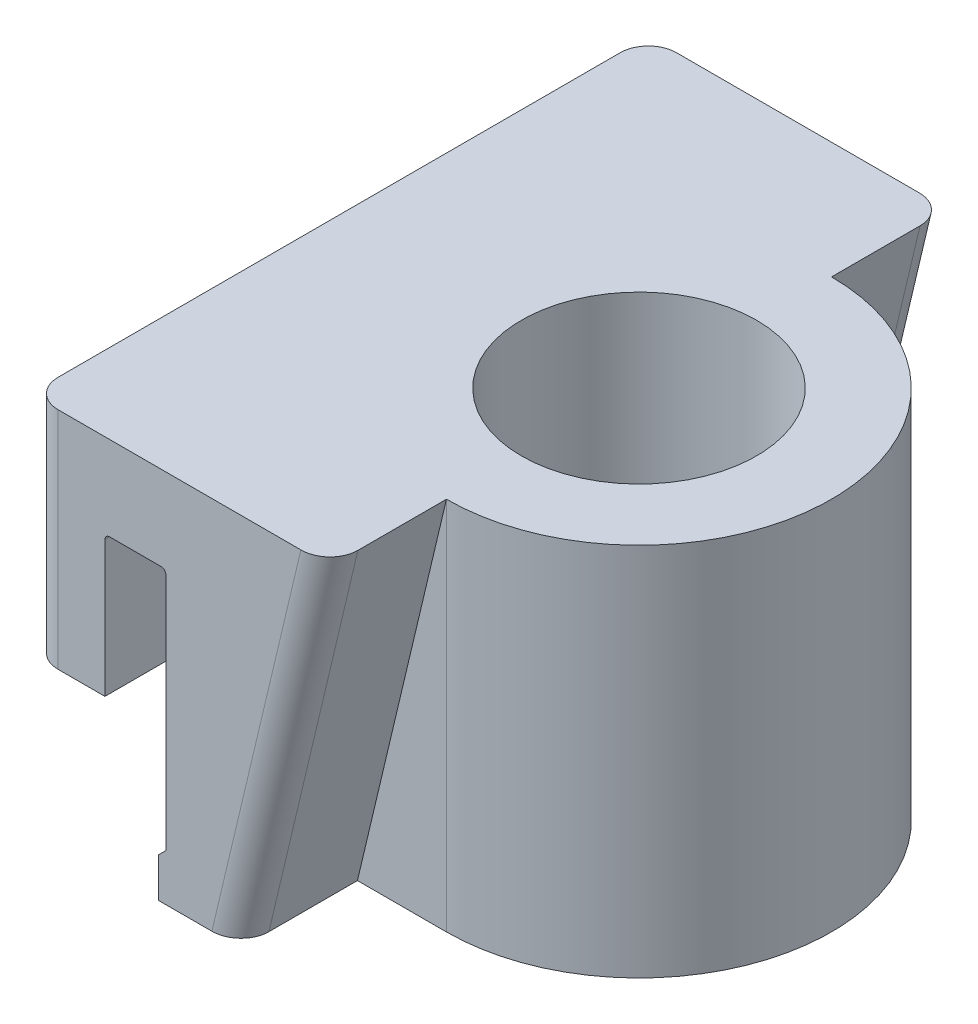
ISO-10303-21;
HEADER;
FILE_DESCRIPTION(('STEP AP214'),'2;1');
FILE_NAME('part.step','',(''),(''),'','','');
FILE_SCHEMA(('AUTOMOTIVE_DESIGN { 1 0 10303 214 1 1 1 1 }'));
ENDSEC;
DATA;
#1=APPLICATION_CONTEXT('core data for automotive mechanical design processes');
#2=APPLICATION_PROTOCOL_DEFINITION('international standard','automotive_design',2000,#1);
#3=PRODUCT_CONTEXT('',#1,'mechanical');
#4=PRODUCT('Part','Part','',(#3));
#5=PRODUCT_RELATED_PRODUCT_CATEGORY('part','',(#4));
#6=PRODUCT_DEFINITION_FORMATION('','',#4);
#7=PRODUCT_DEFINITION_CONTEXT('part definition',#1,'design');
#8=PRODUCT_DEFINITION('design','',#6,#7);
#9=PRODUCT_DEFINITION_SHAPE('','',#8);
#10=(LENGTH_UNIT() NAMED_UNIT(*) SI_UNIT(.MILLI.,.METRE.));
#11=(NAMED_UNIT(*) PLANE_ANGLE_UNIT() SI_UNIT($,.RADIAN.));
#12=(NAMED_UNIT(*) SI_UNIT($,.STERADIAN.) SOLID_ANGLE_UNIT());
#13=UNCERTAINTY_MEASURE_WITH_UNIT(LENGTH_MEASURE(1.E-05),#10,'distance_accuracy_value','');
#14=(GEOMETRIC_REPRESENTATION_CONTEXT(3) GLOBAL_UNCERTAINTY_ASSIGNED_CONTEXT((#13)) GLOBAL_UNIT_ASSIGNED_CONTEXT((#10,
#11,#12)) REPRESENTATION_CONTEXT('',''));
#15=CARTESIAN_POINT('',(0.,0.,0.));
#16=DIRECTION('',(0.,0.,1.));
#17=DIRECTION('',(1.,0.,0.));
#18=AXIS2_PLACEMENT_3D('',#15,#16,#17);
#19=CARTESIAN_POINT('',(-17.5,-40.,-33.));
#20=DIRECTION('',(1.,0.,0.));
#21=DIRECTION('',(0.,0.,-1.));
#22=AXIS2_PLACEMENT_3D('',#19,#20,#21);
#23=PLANE('',#22);
#24=DIRECTION('',(0.,0.,-1.));
#25=VECTOR('',#24,1.);
#26=CARTESIAN_POINT('',(-17.5,-35.,-33.));
#27=LINE('',#26,#25);
#28=CARTESIAN_POINT('',(-17.5,-35.,33.));
#29=VERTEX_POINT('',#28);
#30=CARTESIAN_POINT('',(-17.5,-35.,-33.));
#31=VERTEX_POINT('',#30);
#32=EDGE_CURVE('E174',#29,#31,#27,.T.);
#33=ORIENTED_EDGE('',*,*,#32,.F.);
#34=DIRECTION('',(0.,1.,0.));
#35=VECTOR('',#34,1.);
#36=CARTESIAN_POINT('',(-17.5,-40.,33.));
#37=LINE('',#36,#35);
#38=CARTESIAN_POINT('',(-17.5,-9.5,33.));
#39=VERTEX_POINT('',#38);
#40=EDGE_CURVE('E234',#29,#39,#37,.T.);
#41=ORIENTED_EDGE('',*,*,#40,.T.);
#42=DIRECTION('',(0.,0.,1.));
#43=VECTOR('',#42,1.);
#44=CARTESIAN_POINT('',(-17.5,-9.5,-33.));
#45=LINE('',#44,#43);
#46=CARTESIAN_POINT('',(-17.5,-9.5,-33.));
#47=VERTEX_POINT('',#46);
#48=EDGE_CURVE('E311',#39,#47,#45,.F.);
#49=ORIENTED_EDGE('',*,*,#48,.T.);
#50=DIRECTION('',(0.,1.,0.));
#51=VECTOR('',#50,1.);
#52=CARTESIAN_POINT('',(-17.5,-40.,-33.));
#53=LINE('',#52,#51);
#54=EDGE_CURVE('E226',#31,#47,#53,.T.);
#55=ORIENTED_EDGE('',*,*,#54,.F.);
#56=EDGE_LOOP('',(#33,#41,#49,#55));
#57=FACE_BOUND('',#56,.T.);
#58=ADVANCED_FACE('F36',(#57),#23,.F.);
#59=CARTESIAN_POINT('',(0.,-40.,-33.));
#60=DIRECTION('',(0.,0.,-1.));
#61=DIRECTION('',(-1.,0.,0.));
#62=AXIS2_PLACEMENT_3D('',#59,#60,#61);
#63=PLANE('',#62);
#64=DIRECTION('',(0.,-1.,0.));
#65=VECTOR('',#64,1.);
#66=CARTESIAN_POINT('',(-18.3,-40.,-33.));
#67=LINE('',#66,#65);
#68=CARTESIAN_POINT('',(-18.3,-35.8,-33.));
#69=VERTEX_POINT('',#68);
#70=CARTESIAN_POINT('',(-18.3,-40.,-33.));
#71=VERTEX_POINT('',#70);
#72=EDGE_CURVE('E167',#69,#71,#67,.T.);
#73=ORIENTED_EDGE('',*,*,#72,.F.);
#74=DIRECTION('',(-0.707106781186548,-0.707106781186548,0.));
#75=VECTOR('',#74,1.);
#76=CARTESIAN_POINT('',(-11.25,-28.75,-33.));
#77=LINE('',#76,#75);
#78=EDGE_CURVE('E44',#69,#31,#77,.F.);
#79=ORIENTED_EDGE('',*,*,#78,.T.);
#80=ORIENTED_EDGE('',*,*,#54,.T.);
#81=CARTESIAN_POINT('',(-18.,-9.5,-33.));
#82=DIRECTION('',(0.,0.,-1.));
#83=DIRECTION('',(-1.,0.,0.));
#84=AXIS2_PLACEMENT_3D('',#81,#82,#83);
#85=CIRCLE('',#84,0.5);
#86=CARTESIAN_POINT('',(-18.,-9.,-33.));
#87=VERTEX_POINT('',#86);
#88=EDGE_CURVE('E321',#47,#87,#85,.F.);
#89=ORIENTED_EDGE('',*,*,#88,.T.);
#90=DIRECTION('',(-1.,0.,0.));
#91=VECTOR('',#90,1.);
#92=CARTESIAN_POINT('',(-24.,-9.,-33.));
#93=LINE('',#92,#91);
#94=CARTESIAN_POINT('',(-23.5,-9.,-33.));
#95=VERTEX_POINT('',#94);
#96=EDGE_CURVE('E229',#87,#95,#93,.T.);
#97=ORIENTED_EDGE('',*,*,#96,.T.);
#98=CARTESIAN_POINT('',(-23.5,-9.5,-33.));
#99=DIRECTION('',(0.,0.,-1.));
#100=DIRECTION('',(-1.,0.,0.));
#101=AXIS2_PLACEMENT_3D('',#98,#99,#100);
#102=CIRCLE('',#101,0.5);
#103=CARTESIAN_POINT('',(-24.,-9.5,-33.));
#104=VERTEX_POINT('',#103);
#105=EDGE_CURVE('E316',#95,#104,#102,.F.);
#106=ORIENTED_EDGE('',*,*,#105,.T.);
#107=DIRECTION('',(0.,-1.,0.));
#108=VECTOR('',#107,1.);
#109=CARTESIAN_POINT('',(-24.,-40.,-33.));
#110=LINE('',#109,#108);
#111=CARTESIAN_POINT('',(-24.,-24.,-33.));
#112=VERTEX_POINT('',#111);
#113=EDGE_CURVE('E224',#104,#112,#110,.T.);
#114=ORIENTED_EDGE('',*,*,#113,.T.);
#115=DIRECTION('',(-1.,0.,0.));
#116=VECTOR('',#115,1.);
#117=CARTESIAN_POINT('',(-32.,-24.,-33.));
#118=LINE('',#117,#116);
#119=CARTESIAN_POINT('',(-29.,-24.,-33.));
#120=VERTEX_POINT('',#119);
#121=EDGE_CURVE('E212',#112,#120,#118,.T.);
#122=ORIENTED_EDGE('',*,*,#121,.T.);
#123=DIRECTION('',(0.,1.,0.));
#124=VECTOR('',#123,1.);
#125=CARTESIAN_POINT('',(-29.,-40.,-33.));
#126=LINE('',#125,#124);
#127=CARTESIAN_POINT('',(-29.,0.,-33.));
#128=VERTEX_POINT('',#127);
#129=EDGE_CURVE('E270',#120,#128,#126,.T.);
#130=ORIENTED_EDGE('',*,*,#129,.T.);
#131=DIRECTION('',(-1.,0.,0.));
#132=VECTOR('',#131,1.);
#133=CARTESIAN_POINT('',(0.,0.,-33.));
#134=LINE('',#133,#132);
#135=CARTESIAN_POINT('',(-3.08344875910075,0.,-33.));
#136=VERTEX_POINT('',#135);
#137=EDGE_CURVE('E254',#136,#128,#134,.T.);
#138=ORIENTED_EDGE('',*,*,#137,.F.);
#139=DIRECTION('',(-0.231072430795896,-0.972936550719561,0.));
#140=VECTOR('',#139,1.);
#141=CARTESIAN_POINT('',(-11.9115622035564,-37.1710039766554,-33.));
#142=LINE('',#141,#140);
#143=CARTESIAN_POINT('',(-12.5834487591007,-40.,-33.));
#144=VERTEX_POINT('',#143);
#145=EDGE_CURVE('E182',#136,#144,#142,.T.);
#146=ORIENTED_EDGE('',*,*,#145,.T.);
#147=DIRECTION('',(-1.,0.,0.));
#148=VECTOR('',#147,1.);
#149=CARTESIAN_POINT('',(0.,-40.,-33.));
#150=LINE('',#149,#148);
#151=EDGE_CURVE('E178',#144,#71,#150,.T.);
#152=ORIENTED_EDGE('',*,*,#151,.T.);
#153=EDGE_LOOP('',(#73,#79,#80,#89,#97,#106,#114,#122,#130,#138,#146,#152));
#154=FACE_BOUND('',#153,.T.);
#155=ADVANCED_FACE('F179',(#154),#63,.T.);
#156=CARTESIAN_POINT('',(0.,-40.,0.));
#157=DIRECTION('',(0.,-1.,0.));
#158=DIRECTION('',(0.,0.,-1.));
#159=AXIS2_PLACEMENT_3D('',#156,#157,#158);
#160=PLANE('',#159);
#161=CARTESIAN_POINT('',(0.,-40.,0.));
#162=DIRECTION('',(0.,1.,0.));
#163=DIRECTION('',(0.,0.,1.));
#164=AXIS2_PLACEMENT_3D('',#161,#162,#163);
#165=CIRCLE('',#164,12.55);
#166=CARTESIAN_POINT('',(0.,-40.,12.55));
#167=VERTEX_POINT('',#166);
#168=EDGE_CURVE('E238',#167,#167,#165,.T.);
#169=ORIENTED_EDGE('',*,*,#168,.T.);
#170=EDGE_LOOP('',(#169));
#171=FACE_BOUND('',#170,.T.);
#172=ORIENTED_EDGE('',*,*,#151,.F.);
#173=CARTESIAN_POINT('',(-12.5834487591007,-40.,-30.));
#174=DIRECTION('',(0.,-1.,0.));
#175=DIRECTION('',(-1.,0.,0.));
#176=AXIS2_PLACEMENT_3D('',#173,#174,#175);
#177=ELLIPSE('',#176,3.08344875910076,3.);
#178=CARTESIAN_POINT('',(-9.49999999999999,-40.,-30.));
#179=VERTEX_POINT('',#178);
#180=EDGE_CURVE('E292',#144,#179,#177,.T.);
#181=ORIENTED_EDGE('',*,*,#180,.T.);
#182=DIRECTION('',(0.,0.,-1.));
#183=VECTOR('',#182,1.);
#184=CARTESIAN_POINT('',(-9.49999999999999,-40.,-20.55));
#185=LINE('',#184,#183);
#186=CARTESIAN_POINT('',(-9.49999999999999,-40.,-20.55));
#187=VERTEX_POINT('',#186);
#188=EDGE_CURVE('E200',#187,#179,#185,.T.);
#189=ORIENTED_EDGE('',*,*,#188,.F.);
#190=DIRECTION('',(1.,0.,0.));
#191=VECTOR('',#190,1.);
#192=CARTESIAN_POINT('',(0.,-40.,-20.55));
#193=LINE('',#192,#191);
#194=CARTESIAN_POINT('',(0.,-40.,-20.55));
#195=VERTEX_POINT('',#194);
#196=EDGE_CURVE('E197',#187,#195,#193,.T.);
#197=ORIENTED_EDGE('',*,*,#196,.T.);
#198=CARTESIAN_POINT('',(0.,-40.,0.));
#199=DIRECTION('',(0.,1.,0.));
#200=DIRECTION('',(0.,0.,-1.));
#201=AXIS2_PLACEMENT_3D('',#198,#199,#200);
#202=CIRCLE('',#201,20.55);
#203=CARTESIAN_POINT('',(0.,-40.,20.55));
#204=VERTEX_POINT('',#203);
#205=EDGE_CURVE('E185',#204,#195,#202,.T.);
#206=ORIENTED_EDGE('',*,*,#205,.F.);
#207=DIRECTION('',(1.,0.,0.));
#208=VECTOR('',#207,1.);
#209=CARTESIAN_POINT('',(0.,-40.,20.55));
#210=LINE('',#209,#208);
#211=CARTESIAN_POINT('',(-9.49999999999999,-40.,20.55));
#212=VERTEX_POINT('',#211);
#213=EDGE_CURVE('E203',#212,#204,#210,.T.);
#214=ORIENTED_EDGE('',*,*,#213,.F.);
#215=DIRECTION('',(0.,0.,1.));
#216=VECTOR('',#215,1.);
#217=CARTESIAN_POINT('',(-9.49999999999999,-40.,20.55));
#218=LINE('',#217,#216);
#219=CARTESIAN_POINT('',(-9.49999999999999,-40.,30.));
#220=VERTEX_POINT('',#219);
#221=EDGE_CURVE('E208',#212,#220,#218,.T.);
#222=ORIENTED_EDGE('',*,*,#221,.T.);
#223=CARTESIAN_POINT('',(-12.5834487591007,-40.,30.));
#224=DIRECTION('',(0.,-1.,0.));
#225=DIRECTION('',(1.,0.,0.));
#226=AXIS2_PLACEMENT_3D('',#223,#224,#225);
#227=ELLIPSE('',#226,3.08344875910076,3.);
#228=CARTESIAN_POINT('',(-12.5834487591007,-40.,33.));
#229=VERTEX_POINT('',#228);
#230=EDGE_CURVE('E290',#220,#229,#227,.T.);
#231=ORIENTED_EDGE('',*,*,#230,.T.);
#232=DIRECTION('',(1.,0.,0.));
#233=VECTOR('',#232,1.);
#234=CARTESIAN_POINT('',(0.,-40.,33.));
#235=LINE('',#234,#233);
#236=CARTESIAN_POINT('',(-18.3,-40.,33.));
#237=VERTEX_POINT('',#236);
#238=EDGE_CURVE('E184',#237,#229,#235,.T.);
#239=ORIENTED_EDGE('',*,*,#238,.F.);
#240=DIRECTION('',(0.,0.,1.));
#241=VECTOR('',#240,1.);
#242=CARTESIAN_POINT('',(-18.3,-40.,-33.));
#243=LINE('',#242,#241);
#244=EDGE_CURVE('E171',#71,#237,#243,.T.);
#245=ORIENTED_EDGE('',*,*,#244,.F.);
#246=EDGE_LOOP('',(#172,#181,#189,#197,#206,#214,#222,#231,#239,#245));
#247=FACE_BOUND('',#246,.T.);
#248=ADVANCED_FACE('F187',(#171,#247),#160,.T.);
#249=CARTESIAN_POINT('',(0.,-40.,0.));
#250=DIRECTION('',(0.,1.,0.));
#251=DIRECTION('',(0.,0.,1.));
#252=AXIS2_PLACEMENT_3D('',#249,#250,#251);
#253=CYLINDRICAL_SURFACE('',#252,20.55);
#254=CARTESIAN_POINT('',(0.,0.,0.));
#255=DIRECTION('',(0.,1.,0.));
#256=DIRECTION('',(0.,0.,-1.));
#257=AXIS2_PLACEMENT_3D('',#254,#255,#256);
#258=CIRCLE('',#257,20.55);
#259=CARTESIAN_POINT('',(0.,0.,20.55));
#260=VERTEX_POINT('',#259);
#261=CARTESIAN_POINT('',(0.,0.,-20.55));
#262=VERTEX_POINT('',#261);
#263=EDGE_CURVE('E241',#260,#262,#258,.T.);
#264=ORIENTED_EDGE('',*,*,#263,.F.);
#265=DIRECTION('',(0.,1.,0.));
#266=VECTOR('',#265,1.);
#267=CARTESIAN_POINT('',(0.,-40.,20.55));
#268=LINE('',#267,#266);
#269=EDGE_CURVE('E264',#204,#260,#268,.T.);
#270=ORIENTED_EDGE('',*,*,#269,.F.);
#271=ORIENTED_EDGE('',*,*,#205,.T.);
#272=DIRECTION('',(0.,1.,0.));
#273=VECTOR('',#272,1.);
#274=CARTESIAN_POINT('',(0.,-40.,-20.55));
#275=LINE('',#274,#273);
#276=EDGE_CURVE('E248',#195,#262,#275,.T.);
#277=ORIENTED_EDGE('',*,*,#276,.T.);
#278=EDGE_LOOP('',(#264,#270,#271,#277));
#279=FACE_BOUND('',#278,.T.);
#280=ADVANCED_FACE('F354',(#279),#253,.T.);
#281=CARTESIAN_POINT('',(0.,-40.,33.));
#282=DIRECTION('',(0.,0.,1.));
#283=DIRECTION('',(1.,0.,0.));
#284=AXIS2_PLACEMENT_3D('',#281,#282,#283);
#285=PLANE('',#284);
#286=ORIENTED_EDGE('',*,*,#40,.F.);
#287=DIRECTION('',(0.707106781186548,0.707106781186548,0.));
#288=VECTOR('',#287,1.);
#289=CARTESIAN_POINT('',(-11.25,-28.75,33.));
#290=LINE('',#289,#288);
#291=CARTESIAN_POINT('',(-18.3,-35.8,33.));
#292=VERTEX_POINT('',#291);
#293=EDGE_CURVE('E11',#29,#292,#290,.F.);
#294=ORIENTED_EDGE('',*,*,#293,.T.);
#295=DIRECTION('',(0.,1.,0.));
#296=VECTOR('',#295,1.);
#297=CARTESIAN_POINT('',(-18.3,-40.,33.));
#298=LINE('',#297,#296);
#299=EDGE_CURVE('E189',#237,#292,#298,.T.);
#300=ORIENTED_EDGE('',*,*,#299,.F.);
#301=ORIENTED_EDGE('',*,*,#238,.T.);
#302=DIRECTION('',(-0.231072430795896,-0.972936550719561,0.));
#303=VECTOR('',#302,1.);
#304=CARTESIAN_POINT('',(-2.91880965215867,0.6932172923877,33.));
#305=LINE('',#304,#303);
#306=CARTESIAN_POINT('',(-3.08344875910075,0.,33.));
#307=VERTEX_POINT('',#306);
#308=EDGE_CURVE('E296',#229,#307,#305,.F.);
#309=ORIENTED_EDGE('',*,*,#308,.T.);
#310=DIRECTION('',(1.,0.,0.));
#311=VECTOR('',#310,1.);
#312=CARTESIAN_POINT('',(0.,0.,33.));
#313=LINE('',#312,#311);
#314=CARTESIAN_POINT('',(-29.,0.,33.));
#315=VERTEX_POINT('',#314);
#316=EDGE_CURVE('E260',#315,#307,#313,.T.);
#317=ORIENTED_EDGE('',*,*,#316,.F.);
#318=DIRECTION('',(0.,1.,0.));
#319=VECTOR('',#318,1.);
#320=CARTESIAN_POINT('',(-29.,-40.,33.));
#321=LINE('',#320,#319);
#322=CARTESIAN_POINT('',(-29.,-24.,33.));
#323=VERTEX_POINT('',#322);
#324=EDGE_CURVE('E298',#315,#323,#321,.F.);
#325=ORIENTED_EDGE('',*,*,#324,.T.);
#326=DIRECTION('',(-1.,0.,0.));
#327=VECTOR('',#326,1.);
#328=CARTESIAN_POINT('',(-32.,-24.,33.));
#329=LINE('',#328,#327);
#330=CARTESIAN_POINT('',(-24.,-24.,33.));
#331=VERTEX_POINT('',#330);
#332=EDGE_CURVE('E211',#331,#323,#329,.T.);
#333=ORIENTED_EDGE('',*,*,#332,.F.);
#334=DIRECTION('',(0.,-1.,0.));
#335=VECTOR('',#334,1.);
#336=CARTESIAN_POINT('',(-24.,-40.,33.));
#337=LINE('',#336,#335);
#338=CARTESIAN_POINT('',(-24.,-9.5,33.));
#339=VERTEX_POINT('',#338);
#340=EDGE_CURVE('E221',#339,#331,#337,.T.);
#341=ORIENTED_EDGE('',*,*,#340,.F.);
#342=CARTESIAN_POINT('',(-23.5,-9.5,33.));
#343=DIRECTION('',(0.,0.,1.));
#344=DIRECTION('',(1.,0.,0.));
#345=AXIS2_PLACEMENT_3D('',#342,#343,#344);
#346=CIRCLE('',#345,0.5);
#347=CARTESIAN_POINT('',(-23.5,-9.,33.));
#348=VERTEX_POINT('',#347);
#349=EDGE_CURVE('E314',#339,#348,#346,.F.);
#350=ORIENTED_EDGE('',*,*,#349,.T.);
#351=DIRECTION('',(-1.,0.,0.));
#352=VECTOR('',#351,1.);
#353=CARTESIAN_POINT('',(-24.,-9.,33.));
#354=LINE('',#353,#352);
#355=CARTESIAN_POINT('',(-18.,-9.,33.));
#356=VERTEX_POINT('',#355);
#357=EDGE_CURVE('E227',#356,#348,#354,.T.);
#358=ORIENTED_EDGE('',*,*,#357,.F.);
#359=CARTESIAN_POINT('',(-18.,-9.5,33.));
#360=DIRECTION('',(0.,0.,1.));
#361=DIRECTION('',(1.,0.,0.));
#362=AXIS2_PLACEMENT_3D('',#359,#360,#361);
#363=CIRCLE('',#362,0.5);
#364=EDGE_CURVE('E318',#356,#39,#363,.F.);
#365=ORIENTED_EDGE('',*,*,#364,.T.);
#366=EDGE_LOOP('',(#286,#294,#300,#301,#309,#317,#325,#333,#341,#350,#358,#365));
#367=FACE_BOUND('',#366,.T.);
#368=ADVANCED_FACE('F360',(#367),#285,.T.);
#369=CARTESIAN_POINT('',(-32.,-40.,-33.));
#370=DIRECTION('',(-1.,0.,0.));
#371=DIRECTION('',(0.,0.,1.));
#372=AXIS2_PLACEMENT_3D('',#369,#370,#371);
#373=PLANE('',#372);
#374=DIRECTION('',(0.,0.,1.));
#375=VECTOR('',#374,1.);
#376=CARTESIAN_POINT('',(-32.,0.,-33.));
#377=LINE('',#376,#375);
#378=CARTESIAN_POINT('',(-32.,0.,-30.));
#379=VERTEX_POINT('',#378);
#380=CARTESIAN_POINT('',(-32.,0.,30.));
#381=VERTEX_POINT('',#380);
#382=EDGE_CURVE('E257',#379,#381,#377,.T.);
#383=ORIENTED_EDGE('',*,*,#382,.F.);
#384=DIRECTION('',(0.,1.,0.));
#385=VECTOR('',#384,1.);
#386=CARTESIAN_POINT('',(-32.,-40.,-30.));
#387=LINE('',#386,#385);
#388=CARTESIAN_POINT('',(-32.,-24.,-30.));
#389=VERTEX_POINT('',#388);
#390=EDGE_CURVE('E284',#379,#389,#387,.F.);
#391=ORIENTED_EDGE('',*,*,#390,.T.);
#392=DIRECTION('',(0.,0.,1.));
#393=VECTOR('',#392,1.);
#394=CARTESIAN_POINT('',(-32.,-24.,-33.));
#395=LINE('',#394,#393);
#396=CARTESIAN_POINT('',(-32.,-24.,30.));
#397=VERTEX_POINT('',#396);
#398=EDGE_CURVE('E218',#389,#397,#395,.T.);
#399=ORIENTED_EDGE('',*,*,#398,.T.);
#400=DIRECTION('',(0.,1.,0.));
#401=VECTOR('',#400,1.);
#402=CARTESIAN_POINT('',(-32.,-40.,30.));
#403=LINE('',#402,#401);
#404=EDGE_CURVE('E281',#397,#381,#403,.T.);
#405=ORIENTED_EDGE('',*,*,#404,.T.);
#406=EDGE_LOOP('',(#383,#391,#399,#405));
#407=FACE_BOUND('',#406,.T.);
#408=ADVANCED_FACE('F358',(#407),#373,.T.);
#409=CARTESIAN_POINT('',(0.,0.,0.));
#410=DIRECTION('',(0.,-1.,0.));
#411=DIRECTION('',(0.,0.,-1.));
#412=AXIS2_PLACEMENT_3D('',#409,#410,#411);
#413=PLANE('',#412);
#414=CARTESIAN_POINT('',(0.,0.,0.));
#415=DIRECTION('',(0.,1.,0.));
#416=DIRECTION('',(0.,0.,1.));
#417=AXIS2_PLACEMENT_3D('',#414,#415,#416);
#418=CIRCLE('',#417,12.55);
#419=CARTESIAN_POINT('',(0.,0.,12.55));
#420=VERTEX_POINT('',#419);
#421=EDGE_CURVE('E232',#420,#420,#418,.T.);
#422=ORIENTED_EDGE('',*,*,#421,.F.);
#423=EDGE_LOOP('',(#422));
#424=FACE_BOUND('',#423,.T.);
#425=ORIENTED_EDGE('',*,*,#137,.T.);
#426=CARTESIAN_POINT('',(-29.,0.,-30.));
#427=DIRECTION('',(0.,-1.,0.));
#428=DIRECTION('',(0.,0.,-1.));
#429=AXIS2_PLACEMENT_3D('',#426,#427,#428);
#430=CIRCLE('',#429,3.);
#431=EDGE_CURVE('E279',#128,#379,#430,.F.);
#432=ORIENTED_EDGE('',*,*,#431,.T.);
#433=ORIENTED_EDGE('',*,*,#382,.T.);
#434=CARTESIAN_POINT('',(-29.,0.,30.));
#435=DIRECTION('',(0.,-1.,0.));
#436=DIRECTION('',(0.,0.,-1.));
#437=AXIS2_PLACEMENT_3D('',#434,#435,#436);
#438=CIRCLE('',#437,3.);
#439=EDGE_CURVE('E275',#381,#315,#438,.F.);
#440=ORIENTED_EDGE('',*,*,#439,.T.);
#441=ORIENTED_EDGE('',*,*,#316,.T.);
#442=CARTESIAN_POINT('',(-3.08344875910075,0.,30.));
#443=DIRECTION('',(0.,-1.,0.));
#444=DIRECTION('',(1.,0.,0.));
#445=AXIS2_PLACEMENT_3D('',#442,#443,#444);
#446=ELLIPSE('',#445,3.08344875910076,3.);
#447=CARTESIAN_POINT('',(0.,0.,30.));
#448=VERTEX_POINT('',#447);
#449=EDGE_CURVE('E273',#307,#448,#446,.F.);
#450=ORIENTED_EDGE('',*,*,#449,.T.);
#451=DIRECTION('',(0.,0.,-1.));
#452=VECTOR('',#451,1.);
#453=CARTESIAN_POINT('',(0.,0.,20.55));
#454=LINE('',#453,#452);
#455=EDGE_CURVE('E245',#448,#260,#454,.T.);
#456=ORIENTED_EDGE('',*,*,#455,.T.);
#457=ORIENTED_EDGE('',*,*,#263,.T.);
#458=DIRECTION('',(0.,0.,-1.));
#459=VECTOR('',#458,1.);
#460=CARTESIAN_POINT('',(0.,0.,-20.55));
#461=LINE('',#460,#459);
#462=CARTESIAN_POINT('',(0.,0.,-30.));
#463=VERTEX_POINT('',#462);
#464=EDGE_CURVE('E251',#262,#463,#461,.T.);
#465=ORIENTED_EDGE('',*,*,#464,.T.);
#466=CARTESIAN_POINT('',(-3.08344875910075,0.,-30.));
#467=DIRECTION('',(0.,-1.,0.));
#468=DIRECTION('',(-1.,0.,0.));
#469=AXIS2_PLACEMENT_3D('',#466,#467,#468);
#470=ELLIPSE('',#469,3.08344875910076,3.);
#471=EDGE_CURVE('E277',#463,#136,#470,.F.);
#472=ORIENTED_EDGE('',*,*,#471,.T.);
#473=EDGE_LOOP('',(#425,#432,#433,#440,#441,#450,#456,#457,#465,#472));
#474=FACE_BOUND('',#473,.T.);
#475=ADVANCED_FACE('F350',(#424,#474),#413,.F.);
#476=CARTESIAN_POINT('',(0.,-40.,0.));
#477=DIRECTION('',(0.,1.,0.));
#478=DIRECTION('',(0.,0.,1.));
#479=AXIS2_PLACEMENT_3D('',#476,#477,#478);
#480=CYLINDRICAL_SURFACE('',#479,12.55);
#481=ORIENTED_EDGE('',*,*,#168,.F.);
#482=EDGE_LOOP('',(#481));
#483=FACE_BOUND('',#482,.T.);
#484=ORIENTED_EDGE('',*,*,#421,.T.);
#485=EDGE_LOOP('',(#484));
#486=FACE_BOUND('',#485,.T.);
#487=ADVANCED_FACE('F346',(#483,#486),#480,.F.);
#488=CARTESIAN_POINT('',(-24.,-40.,-33.));
#489=DIRECTION('',(-1.,0.,0.));
#490=DIRECTION('',(0.,0.,1.));
#491=AXIS2_PLACEMENT_3D('',#488,#489,#490);
#492=PLANE('',#491);
#493=ORIENTED_EDGE('',*,*,#113,.F.);
#494=DIRECTION('',(0.,0.,1.));
#495=VECTOR('',#494,1.);
#496=CARTESIAN_POINT('',(-24.,-9.5,33.));
#497=LINE('',#496,#495);
#498=EDGE_CURVE('E303',#104,#339,#497,.T.);
#499=ORIENTED_EDGE('',*,*,#498,.T.);
#500=ORIENTED_EDGE('',*,*,#340,.T.);
#501=DIRECTION('',(0.,0.,1.));
#502=VECTOR('',#501,1.);
#503=CARTESIAN_POINT('',(-24.,-24.,-33.));
#504=LINE('',#503,#502);
#505=EDGE_CURVE('E215',#112,#331,#504,.T.);
#506=ORIENTED_EDGE('',*,*,#505,.F.);
#507=EDGE_LOOP('',(#493,#499,#500,#506));
#508=FACE_BOUND('',#507,.T.);
#509=ADVANCED_FACE('F343',(#508),#492,.F.);
#510=CARTESIAN_POINT('',(-24.,-9.,-33.));
#511=DIRECTION('',(0.,1.,0.));
#512=DIRECTION('',(-1.,0.,0.));
#513=AXIS2_PLACEMENT_3D('',#510,#511,#512);
#514=PLANE('',#513);
#515=ORIENTED_EDGE('',*,*,#357,.T.);
#516=DIRECTION('',(0.,0.,1.));
#517=VECTOR('',#516,1.);
#518=CARTESIAN_POINT('',(-23.5,-9.,-33.));
#519=LINE('',#518,#517);
#520=EDGE_CURVE('E309',#348,#95,#519,.F.);
#521=ORIENTED_EDGE('',*,*,#520,.T.);
#522=ORIENTED_EDGE('',*,*,#96,.F.);
#523=DIRECTION('',(0.,0.,1.));
#524=VECTOR('',#523,1.);
#525=CARTESIAN_POINT('',(-18.,-9.,33.));
#526=LINE('',#525,#524);
#527=EDGE_CURVE('E306',#87,#356,#526,.T.);
#528=ORIENTED_EDGE('',*,*,#527,.T.);
#529=EDGE_LOOP('',(#515,#521,#522,#528));
#530=FACE_BOUND('',#529,.T.);
#531=ADVANCED_FACE('F341',(#530),#514,.F.);
#532=CARTESIAN_POINT('',(-32.,-24.,-33.));
#533=DIRECTION('',(0.,1.,0.));
#534=DIRECTION('',(0.,0.,1.));
#535=AXIS2_PLACEMENT_3D('',#532,#533,#534);
#536=PLANE('',#535);
#537=ORIENTED_EDGE('',*,*,#398,.F.);
#538=CARTESIAN_POINT('',(-29.,-24.,-30.));
#539=DIRECTION('',(0.,1.,0.));
#540=DIRECTION('',(0.,0.,1.));
#541=AXIS2_PLACEMENT_3D('',#538,#539,#540);
#542=CIRCLE('',#541,3.);
#543=EDGE_CURVE('E288',#389,#120,#542,.F.);
#544=ORIENTED_EDGE('',*,*,#543,.T.);
#545=ORIENTED_EDGE('',*,*,#121,.F.);
#546=ORIENTED_EDGE('',*,*,#505,.T.);
#547=ORIENTED_EDGE('',*,*,#332,.T.);
#548=CARTESIAN_POINT('',(-29.,-24.,30.));
#549=DIRECTION('',(0.,1.,0.));
#550=DIRECTION('',(0.,0.,1.));
#551=AXIS2_PLACEMENT_3D('',#548,#549,#550);
#552=CIRCLE('',#551,3.);
#553=EDGE_CURVE('E286',#323,#397,#552,.F.);
#554=ORIENTED_EDGE('',*,*,#553,.T.);
#555=EDGE_LOOP('',(#537,#544,#545,#546,#547,#554));
#556=FACE_BOUND('',#555,.T.);
#557=ADVANCED_FACE('F407',(#556),#536,.F.);
#558=CARTESIAN_POINT('',(-9.49999999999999,-40.,20.55));
#559=DIRECTION('',(-0.972936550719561,0.231072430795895,0.));
#560=DIRECTION('',(-0.231072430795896,-0.972936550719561,0.));
#561=AXIS2_PLACEMENT_3D('',#558,#559,#560);
#562=PLANE('',#561);
#563=ORIENTED_EDGE('',*,*,#455,.F.);
#564=DIRECTION('',(-0.231072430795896,-0.972936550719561,0.));
#565=VECTOR('',#564,1.);
#566=CARTESIAN_POINT('',(-9.49999999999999,-40.,30.));
#567=LINE('',#566,#565);
#568=EDGE_CURVE('E300',#448,#220,#567,.T.);
#569=ORIENTED_EDGE('',*,*,#568,.T.);
#570=ORIENTED_EDGE('',*,*,#221,.F.);
#571=DIRECTION('',(-0.231072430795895,-0.972936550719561,0.));
#572=VECTOR('',#571,1.);
#573=CARTESIAN_POINT('',(-9.49999999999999,-40.,20.55));
#574=LINE('',#573,#572);
#575=EDGE_CURVE('E205',#260,#212,#574,.T.);
#576=ORIENTED_EDGE('',*,*,#575,.F.);
#577=EDGE_LOOP('',(#563,#569,#570,#576));
#578=FACE_BOUND('',#577,.T.);
#579=ADVANCED_FACE('F432',(#578),#562,.F.);
#580=CARTESIAN_POINT('',(0.,0.,20.55));
#581=DIRECTION('',(0.,0.,1.));
#582=DIRECTION('',(1.,0.,0.));
#583=AXIS2_PLACEMENT_3D('',#580,#581,#582);
#584=PLANE('',#583);
#585=ORIENTED_EDGE('',*,*,#213,.T.);
#586=ORIENTED_EDGE('',*,*,#269,.T.);
#587=ORIENTED_EDGE('',*,*,#575,.T.);
#588=EDGE_LOOP('',(#585,#586,#587));
#589=FACE_BOUND('',#588,.T.);
#590=ADVANCED_FACE('F435',(#589),#584,.T.);
#591=CARTESIAN_POINT('',(-9.49999999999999,-40.,-20.55));
#592=DIRECTION('',(0.972936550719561,-0.231072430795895,0.));
#593=DIRECTION('',(0.231072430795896,0.972936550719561,0.));
#594=AXIS2_PLACEMENT_3D('',#591,#592,#593);
#595=PLANE('',#594);
#596=ORIENTED_EDGE('',*,*,#188,.T.);
#597=DIRECTION('',(-0.231072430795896,-0.972936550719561,0.));
#598=VECTOR('',#597,1.);
#599=CARTESIAN_POINT('',(-9.49999999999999,-40.,-30.));
#600=LINE('',#599,#598);
#601=EDGE_CURVE('E294',#179,#463,#600,.F.);
#602=ORIENTED_EDGE('',*,*,#601,.T.);
#603=ORIENTED_EDGE('',*,*,#464,.F.);
#604=DIRECTION('',(-0.231072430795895,-0.972936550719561,0.));
#605=VECTOR('',#604,1.);
#606=CARTESIAN_POINT('',(-9.49999999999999,-40.,-20.55));
#607=LINE('',#606,#605);
#608=EDGE_CURVE('E191',#262,#187,#607,.T.);
#609=ORIENTED_EDGE('',*,*,#608,.T.);
#610=EDGE_LOOP('',(#596,#602,#603,#609));
#611=FACE_BOUND('',#610,.T.);
#612=ADVANCED_FACE('F421',(#611),#595,.T.);
#613=CARTESIAN_POINT('',(0.,0.,-20.55));
#614=DIRECTION('',(0.,0.,1.));
#615=DIRECTION('',(1.,0.,0.));
#616=AXIS2_PLACEMENT_3D('',#613,#614,#615);
#617=PLANE('',#616);
#618=ORIENTED_EDGE('',*,*,#608,.F.);
#619=ORIENTED_EDGE('',*,*,#276,.F.);
#620=ORIENTED_EDGE('',*,*,#196,.F.);
#621=EDGE_LOOP('',(#618,#619,#620));
#622=FACE_BOUND('',#621,.T.);
#623=ADVANCED_FACE('F373',(#622),#617,.F.);
#624=CARTESIAN_POINT('',(-29.,-40.,-30.));
#625=DIRECTION('',(0.,1.,0.));
#626=DIRECTION('',(0.,0.,1.));
#627=AXIS2_PLACEMENT_3D('',#624,#625,#626);
#628=CYLINDRICAL_SURFACE('',#627,3.);
#629=ORIENTED_EDGE('',*,*,#543,.F.);
#630=ORIENTED_EDGE('',*,*,#390,.F.);
#631=ORIENTED_EDGE('',*,*,#431,.F.);
#632=ORIENTED_EDGE('',*,*,#129,.F.);
#633=EDGE_LOOP('',(#629,#630,#631,#632));
#634=FACE_BOUND('',#633,.T.);
#635=ADVANCED_FACE('F369',(#634),#628,.T.);
#636=CARTESIAN_POINT('',(-11.9115622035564,-37.1710039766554,-30.));
#637=DIRECTION('',(-0.231072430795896,-0.972936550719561,0.));
#638=DIRECTION('',(0.972936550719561,-0.231072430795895,0.));
#639=AXIS2_PLACEMENT_3D('',#636,#637,#638);
#640=CYLINDRICAL_SURFACE('',#639,3.);
#641=ORIENTED_EDGE('',*,*,#471,.F.);
#642=ORIENTED_EDGE('',*,*,#601,.F.);
#643=ORIENTED_EDGE('',*,*,#180,.F.);
#644=ORIENTED_EDGE('',*,*,#145,.F.);
#645=EDGE_LOOP('',(#641,#642,#643,#644));
#646=FACE_BOUND('',#645,.T.);
#647=ADVANCED_FACE('F372',(#646),#640,.T.);
#648=CARTESIAN_POINT('',(-29.,-40.,30.));
#649=DIRECTION('',(0.,1.,0.));
#650=DIRECTION('',(0.,0.,1.));
#651=AXIS2_PLACEMENT_3D('',#648,#649,#650);
#652=CYLINDRICAL_SURFACE('',#651,3.);
#653=ORIENTED_EDGE('',*,*,#553,.F.);
#654=ORIENTED_EDGE('',*,*,#324,.F.);
#655=ORIENTED_EDGE('',*,*,#439,.F.);
#656=ORIENTED_EDGE('',*,*,#404,.F.);
#657=EDGE_LOOP('',(#653,#654,#655,#656));
#658=FACE_BOUND('',#657,.T.);
#659=ADVANCED_FACE('F377',(#658),#652,.T.);
#660=CARTESIAN_POINT('',(-12.4188096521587,-39.3067827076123,30.));
#661=DIRECTION('',(0.231072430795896,0.972936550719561,0.));
#662=DIRECTION('',(-0.972936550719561,0.231072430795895,0.));
#663=AXIS2_PLACEMENT_3D('',#660,#661,#662);
#664=CYLINDRICAL_SURFACE('',#663,3.);
#665=ORIENTED_EDGE('',*,*,#449,.F.);
#666=ORIENTED_EDGE('',*,*,#308,.F.);
#667=ORIENTED_EDGE('',*,*,#230,.F.);
#668=ORIENTED_EDGE('',*,*,#568,.F.);
#669=EDGE_LOOP('',(#665,#666,#667,#668));
#670=FACE_BOUND('',#669,.T.);
#671=ADVANCED_FACE('F381',(#670),#664,.T.);
#672=CARTESIAN_POINT('',(-23.5,-9.5,-33.));
#673=DIRECTION('',(0.,0.,-1.));
#674=DIRECTION('',(-1.,0.,0.));
#675=AXIS2_PLACEMENT_3D('',#672,#673,#674);
#676=CYLINDRICAL_SURFACE('',#675,0.5);
#677=ORIENTED_EDGE('',*,*,#105,.F.);
#678=ORIENTED_EDGE('',*,*,#520,.F.);
#679=ORIENTED_EDGE('',*,*,#349,.F.);
#680=ORIENTED_EDGE('',*,*,#498,.F.);
#681=EDGE_LOOP('',(#677,#678,#679,#680));
#682=FACE_BOUND('',#681,.T.);
#683=ADVANCED_FACE('F385',(#682),#676,.F.);
#684=CARTESIAN_POINT('',(-18.,-9.5,-33.));
#685=DIRECTION('',(0.,0.,-1.));
#686=DIRECTION('',(-1.,0.,0.));
#687=AXIS2_PLACEMENT_3D('',#684,#685,#686);
#688=CYLINDRICAL_SURFACE('',#687,0.5);
#689=ORIENTED_EDGE('',*,*,#88,.F.);
#690=ORIENTED_EDGE('',*,*,#48,.F.);
#691=ORIENTED_EDGE('',*,*,#364,.F.);
#692=ORIENTED_EDGE('',*,*,#527,.F.);
#693=EDGE_LOOP('',(#689,#690,#691,#692));
#694=FACE_BOUND('',#693,.T.);
#695=ADVANCED_FACE('F331',(#694),#688,.F.);
#696=CARTESIAN_POINT('',(-18.3,0.,0.));
#697=DIRECTION('',(1.,0.,0.));
#698=DIRECTION('',(0.,0.,-1.));
#699=AXIS2_PLACEMENT_3D('',#696,#697,#698);
#700=PLANE('',#699);
#701=ORIENTED_EDGE('',*,*,#299,.T.);
#702=DIRECTION('',(0.,0.,-1.));
#703=VECTOR('',#702,1.);
#704=CARTESIAN_POINT('',(-18.3,-35.8,0.));
#705=LINE('',#704,#703);
#706=EDGE_CURVE('E172',#292,#69,#705,.T.);
#707=ORIENTED_EDGE('',*,*,#706,.T.);
#708=ORIENTED_EDGE('',*,*,#72,.T.);
#709=ORIENTED_EDGE('',*,*,#244,.T.);
#710=EDGE_LOOP('',(#701,#707,#708,#709));
#711=FACE_BOUND('',#710,.T.);
#712=ADVANCED_FACE('F169',(#711),#700,.F.);
#713=CARTESIAN_POINT('',(-18.3,-35.8,0.));
#714=DIRECTION('',(0.707106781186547,-0.707106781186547,0.));
#715=DIRECTION('',(0.,0.,-1.));
#716=AXIS2_PLACEMENT_3D('',#713,#714,#715);
#717=PLANE('',#716);
#718=ORIENTED_EDGE('',*,*,#293,.F.);
#719=ORIENTED_EDGE('',*,*,#32,.T.);
#720=ORIENTED_EDGE('',*,*,#78,.F.);
#721=ORIENTED_EDGE('',*,*,#706,.F.);
#722=EDGE_LOOP('',(#718,#719,#720,#721));
#723=FACE_BOUND('',#722,.T.);
#724=ADVANCED_FACE('F38',(#723),#717,.F.);
#725=CLOSED_SHELL('',(#58,#155,#248,#280,#368,#408,#475,#487,#509,#531,#557,#579,#590,#612,#623,
#635,#647,#659,#671,#683,#695,#712,#724));
#726=MANIFOLD_SOLID_BREP('B2',#725);
#727=ADVANCED_BREP_SHAPE_REPRESENTATION('',(#18,#726),#14);
#728=SHAPE_DEFINITION_REPRESENTATION(#9,#727);
ENDSEC;
END-ISO-10303-21;
